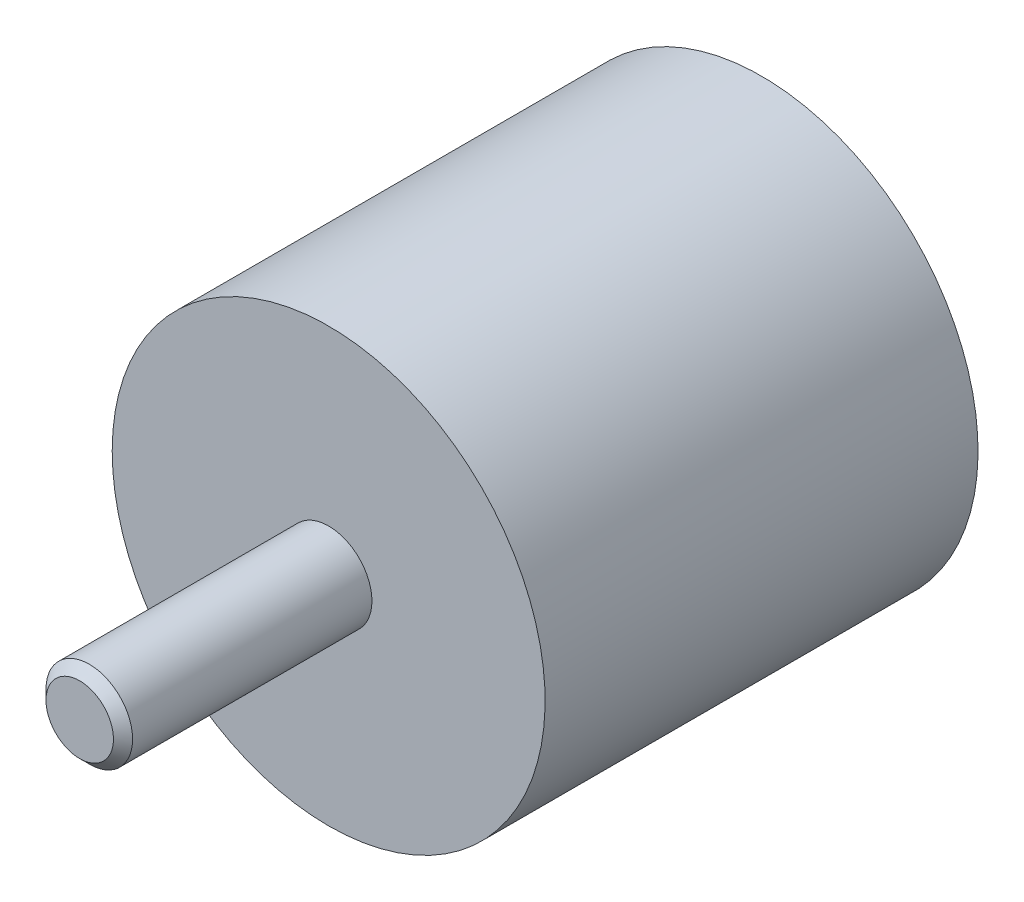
ISO-10303-21;
HEADER;
FILE_DESCRIPTION(('STEP AP214'),'2;1');
FILE_NAME('part.step','',(''),(''),'','','');
FILE_SCHEMA(('AUTOMOTIVE_DESIGN { 1 0 10303 214 1 1 1 1 }'));
ENDSEC;
DATA;
#1=APPLICATION_CONTEXT('core data for automotive mechanical design processes');
#2=APPLICATION_PROTOCOL_DEFINITION('international standard','automotive_design',2000,#1);
#3=PRODUCT_CONTEXT('',#1,'mechanical');
#4=PRODUCT('Part','Part','',(#3));
#5=PRODUCT_RELATED_PRODUCT_CATEGORY('part','',(#4));
#6=PRODUCT_DEFINITION_FORMATION('','',#4);
#7=PRODUCT_DEFINITION_CONTEXT('part definition',#1,'design');
#8=PRODUCT_DEFINITION('design','',#6,#7);
#9=PRODUCT_DEFINITION_SHAPE('','',#8);
#10=(LENGTH_UNIT() NAMED_UNIT(*) SI_UNIT(.MILLI.,.METRE.));
#11=(NAMED_UNIT(*) PLANE_ANGLE_UNIT() SI_UNIT($,.RADIAN.));
#12=(NAMED_UNIT(*) SI_UNIT($,.STERADIAN.) SOLID_ANGLE_UNIT());
#13=UNCERTAINTY_MEASURE_WITH_UNIT(LENGTH_MEASURE(1.E-05),#10,'distance_accuracy_value','');
#14=(GEOMETRIC_REPRESENTATION_CONTEXT(3) GLOBAL_UNCERTAINTY_ASSIGNED_CONTEXT((#13)) GLOBAL_UNIT_ASSIGNED_CONTEXT((#10,
#11,#12)) REPRESENTATION_CONTEXT('',''));
#15=CARTESIAN_POINT('',(0.,0.,0.));
#16=DIRECTION('',(0.,0.,1.));
#17=DIRECTION('',(1.,0.,0.));
#18=AXIS2_PLACEMENT_3D('',#15,#16,#17);
#19=CARTESIAN_POINT('',(0.,0.,0.66666666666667));
#20=DIRECTION('',(0.,0.,1.));
#21=DIRECTION('',(0.,-1.,0.));
#22=AXIS2_PLACEMENT_3D('',#19,#20,#21);
#23=CYLINDRICAL_SURFACE('',#22,20.);
#24=CARTESIAN_POINT('',(0.,0.,0.));
#25=DIRECTION('',(0.,0.,1.));
#26=DIRECTION('',(0.,-1.,0.));
#27=AXIS2_PLACEMENT_3D('',#24,#25,#26);
#28=CIRCLE('',#27,20.);
#29=CARTESIAN_POINT('',(0.,-20.,0.));
#30=VERTEX_POINT('',#29);
#31=EDGE_CURVE('E27',#30,#30,#28,.T.);
#32=ORIENTED_EDGE('',*,*,#31,.T.);
#33=EDGE_LOOP('',(#32));
#34=FACE_BOUND('',#33,.T.);
#35=CARTESIAN_POINT('',(0.,0.,40.));
#36=DIRECTION('',(0.,0.,-1.));
#37=DIRECTION('',(-1.,0.,0.));
#38=AXIS2_PLACEMENT_3D('',#35,#36,#37);
#39=CIRCLE('',#38,20.);
#40=CARTESIAN_POINT('',(-20.,0.,40.));
#41=VERTEX_POINT('',#40);
#42=EDGE_CURVE('E35',#41,#41,#39,.T.);
#43=ORIENTED_EDGE('',*,*,#42,.T.);
#44=EDGE_LOOP('',(#43));
#45=FACE_BOUND('',#44,.T.);
#46=ADVANCED_FACE('F12',(#34,#45),#23,.T.);
#47=CARTESIAN_POINT('',(20.,0.,0.));
#48=DIRECTION('',(0.,0.,-1.));
#49=DIRECTION('',(0.,1.,0.));
#50=AXIS2_PLACEMENT_3D('',#47,#48,#49);
#51=PLANE('',#50);
#52=CARTESIAN_POINT('',(0.,0.,0.));
#53=DIRECTION('',(0.,0.,-1.));
#54=DIRECTION('',(0.,1.,0.));
#55=AXIS2_PLACEMENT_3D('',#52,#53,#54);
#56=CIRCLE('',#55,4.5);
#57=CARTESIAN_POINT('',(0.,4.5,0.));
#58=VERTEX_POINT('',#57);
#59=EDGE_CURVE('E19',#58,#58,#56,.F.);
#60=ORIENTED_EDGE('',*,*,#59,.T.);
#61=EDGE_LOOP('',(#60));
#62=FACE_BOUND('',#61,.T.);
#63=ORIENTED_EDGE('',*,*,#31,.F.);
#64=EDGE_LOOP('',(#63));
#65=FACE_BOUND('',#64,.T.);
#66=ADVANCED_FACE('F58',(#62,#65),#51,.T.);
#67=CARTESIAN_POINT('',(0.,0.,0.));
#68=DIRECTION('',(0.,0.,1.));
#69=DIRECTION('',(0.,-1.,0.));
#70=AXIS2_PLACEMENT_3D('',#67,#68,#69);
#71=CYLINDRICAL_SURFACE('',#70,4.);
#72=CARTESIAN_POINT('',(0.,0.,0.499999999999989));
#73=DIRECTION('',(0.,0.,-1.));
#74=DIRECTION('',(0.,1.,0.));
#75=AXIS2_PLACEMENT_3D('',#72,#73,#74);
#76=CIRCLE('',#75,4.);
#77=CARTESIAN_POINT('',(0.,4.,0.499999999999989));
#78=VERTEX_POINT('',#77);
#79=EDGE_CURVE('E23',#78,#78,#76,.T.);
#80=ORIENTED_EDGE('',*,*,#79,.T.);
#81=EDGE_LOOP('',(#80));
#82=FACE_BOUND('',#81,.T.);
#83=CARTESIAN_POINT('',(0.,0.,8.));
#84=DIRECTION('',(0.,0.,-1.));
#85=DIRECTION('',(0.,1.,0.));
#86=AXIS2_PLACEMENT_3D('',#83,#84,#85);
#87=CIRCLE('',#86,4.);
#88=CARTESIAN_POINT('',(0.,4.,8.));
#89=VERTEX_POINT('',#88);
#90=EDGE_CURVE('E32',#89,#89,#87,.T.);
#91=ORIENTED_EDGE('',*,*,#90,.F.);
#92=EDGE_LOOP('',(#91));
#93=FACE_BOUND('',#92,.T.);
#94=ADVANCED_FACE('F63',(#82,#93),#71,.F.);
#95=CARTESIAN_POINT('',(0.,0.,8.));
#96=DIRECTION('',(0.,0.,-1.));
#97=DIRECTION('',(0.,1.,0.));
#98=AXIS2_PLACEMENT_3D('',#95,#96,#97);
#99=PLANE('',#98);
#100=ORIENTED_EDGE('',*,*,#90,.T.);
#101=EDGE_LOOP('',(#100));
#102=FACE_BOUND('',#101,.T.);
#103=ADVANCED_FACE('F69',(#102),#99,.T.);
#104=CARTESIAN_POINT('',(0.,0.,0.499999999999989));
#105=DIRECTION('',(0.,0.,-1.));
#106=DIRECTION('',(0.,1.,0.));
#107=AXIS2_PLACEMENT_3D('',#104,#105,#106);
#108=CONICAL_SURFACE('',#107,4.,0.785398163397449);
#109=ORIENTED_EDGE('',*,*,#59,.F.);
#110=EDGE_LOOP('',(#109));
#111=FACE_BOUND('',#110,.T.);
#112=ORIENTED_EDGE('',*,*,#79,.F.);
#113=EDGE_LOOP('',(#112));
#114=FACE_BOUND('',#113,.T.);
#115=ADVANCED_FACE('F14',(#111,#114),#108,.F.);
#116=CARTESIAN_POINT('',(0.,20.,40.));
#117=DIRECTION('',(0.,0.,1.));
#118=DIRECTION('',(1.,0.,0.));
#119=AXIS2_PLACEMENT_3D('',#116,#117,#118);
#120=PLANE('',#119);
#121=CARTESIAN_POINT('',(0.,0.,40.));
#122=DIRECTION('',(0.,0.,1.));
#123=DIRECTION('',(1.,0.,0.));
#124=AXIS2_PLACEMENT_3D('',#121,#122,#123);
#125=CIRCLE('',#124,4.);
#126=CARTESIAN_POINT('',(4.,0.,40.));
#127=VERTEX_POINT('',#126);
#128=EDGE_CURVE('E8',#127,#127,#125,.F.);
#129=ORIENTED_EDGE('',*,*,#128,.T.);
#130=EDGE_LOOP('',(#129));
#131=FACE_BOUND('',#130,.T.);
#132=ORIENTED_EDGE('',*,*,#42,.F.);
#133=EDGE_LOOP('',(#132));
#134=FACE_BOUND('',#133,.T.);
#135=ADVANCED_FACE('F73',(#131,#134),#120,.T.);
#136=CARTESIAN_POINT('',(0.,0.,20.));
#137=DIRECTION('',(0.,0.,1.));
#138=DIRECTION('',(0.,-1.,0.));
#139=AXIS2_PLACEMENT_3D('',#136,#137,#138);
#140=CYLINDRICAL_SURFACE('',#139,4.);
#141=ORIENTED_EDGE('',*,*,#128,.F.);
#142=EDGE_LOOP('',(#141));
#143=FACE_BOUND('',#142,.T.);
#144=CARTESIAN_POINT('',(0.,0.,62.1163103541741));
#145=DIRECTION('',(0.,0.,-1.));
#146=DIRECTION('',(-1.,0.,0.));
#147=AXIS2_PLACEMENT_3D('',#144,#145,#146);
#148=CIRCLE('',#147,4.);
#149=CARTESIAN_POINT('',(-4.,0.,62.1163103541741));
#150=VERTEX_POINT('',#149);
#151=EDGE_CURVE('E38',#150,#150,#148,.T.);
#152=ORIENTED_EDGE('',*,*,#151,.T.);
#153=EDGE_LOOP('',(#152));
#154=FACE_BOUND('',#153,.T.);
#155=ADVANCED_FACE('F55',(#143,#154),#140,.T.);
#156=CARTESIAN_POINT('',(0.,0.,62.1163103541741));
#157=DIRECTION('',(0.,0.,-1.));
#158=DIRECTION('',(-1.,0.,0.));
#159=AXIS2_PLACEMENT_3D('',#156,#157,#158);
#160=CONICAL_SURFACE('',#159,4.,0.785398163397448);
#161=CARTESIAN_POINT('',(0.,0.,63.));
#162=DIRECTION('',(0.,0.,-1.));
#163=DIRECTION('',(-1.,0.,0.));
#164=AXIS2_PLACEMENT_3D('',#161,#162,#163);
#165=CIRCLE('',#164,3.11631035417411);
#166=CARTESIAN_POINT('',(-3.11631035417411,0.,63.));
#167=VERTEX_POINT('',#166);
#168=EDGE_CURVE('E41',#167,#167,#165,.T.);
#169=ORIENTED_EDGE('',*,*,#168,.T.);
#170=EDGE_LOOP('',(#169));
#171=FACE_BOUND('',#170,.T.);
#172=ORIENTED_EDGE('',*,*,#151,.F.);
#173=EDGE_LOOP('',(#172));
#174=FACE_BOUND('',#173,.T.);
#175=ADVANCED_FACE('F45',(#171,#174),#160,.T.);
#176=CARTESIAN_POINT('',(0.,3.11631035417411,63.));
#177=DIRECTION('',(0.,0.,1.));
#178=DIRECTION('',(1.,0.,0.));
#179=AXIS2_PLACEMENT_3D('',#176,#177,#178);
#180=PLANE('',#179);
#181=ORIENTED_EDGE('',*,*,#168,.F.);
#182=EDGE_LOOP('',(#181));
#183=FACE_BOUND('',#182,.T.);
#184=ADVANCED_FACE('F48',(#183),#180,.T.);
#185=CLOSED_SHELL('',(#46,#66,#94,#103,#115,#135,#155,#175,#184));
#186=MANIFOLD_SOLID_BREP('B1',#185);
#187=ADVANCED_BREP_SHAPE_REPRESENTATION('',(#18,#186),#14);
#188=SHAPE_DEFINITION_REPRESENTATION(#9,#187);
ENDSEC;
END-ISO-10303-21;
